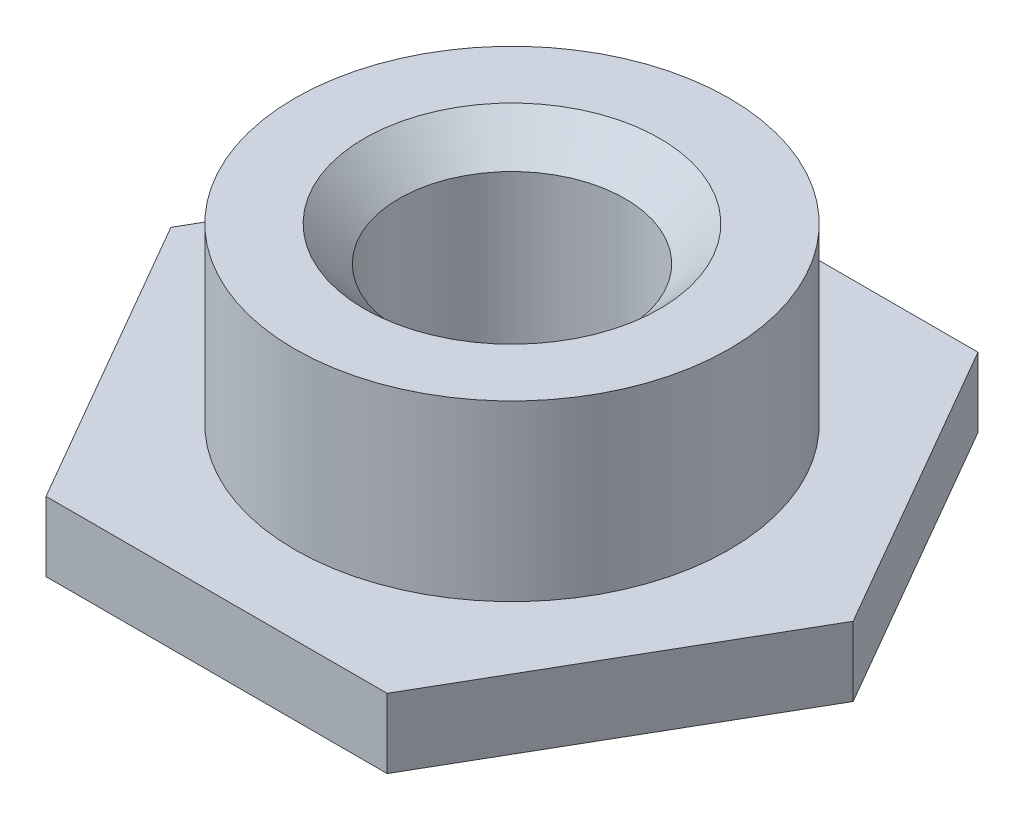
ISO-10303-21;
HEADER;
FILE_DESCRIPTION(('STEP AP214'),'2;1');
FILE_NAME('part.step','',(''),(''),'','','');
FILE_SCHEMA(('AUTOMOTIVE_DESIGN { 1 0 10303 214 1 1 1 1 }'));
ENDSEC;
DATA;
#1=APPLICATION_CONTEXT('core data for automotive mechanical design processes');
#2=APPLICATION_PROTOCOL_DEFINITION('international standard','automotive_design',2000,#1);
#3=PRODUCT_CONTEXT('',#1,'mechanical');
#4=PRODUCT('Part','Part','',(#3));
#5=PRODUCT_RELATED_PRODUCT_CATEGORY('part','',(#4));
#6=PRODUCT_DEFINITION_FORMATION('','',#4);
#7=PRODUCT_DEFINITION_CONTEXT('part definition',#1,'design');
#8=PRODUCT_DEFINITION('design','',#6,#7);
#9=PRODUCT_DEFINITION_SHAPE('','',#8);
#10=(LENGTH_UNIT() NAMED_UNIT(*) SI_UNIT(.MILLI.,.METRE.));
#11=(NAMED_UNIT(*) PLANE_ANGLE_UNIT() SI_UNIT($,.RADIAN.));
#12=(NAMED_UNIT(*) SI_UNIT($,.STERADIAN.) SOLID_ANGLE_UNIT());
#13=UNCERTAINTY_MEASURE_WITH_UNIT(LENGTH_MEASURE(1.E-05),#10,'distance_accuracy_value','');
#14=(GEOMETRIC_REPRESENTATION_CONTEXT(3) GLOBAL_UNCERTAINTY_ASSIGNED_CONTEXT((#13)) GLOBAL_UNIT_ASSIGNED_CONTEXT((#10,
#11,#12)) REPRESENTATION_CONTEXT('',''));
#15=CARTESIAN_POINT('',(0.,0.,0.));
#16=DIRECTION('',(0.,0.,1.));
#17=DIRECTION('',(1.,0.,0.));
#18=AXIS2_PLACEMENT_3D('',#15,#16,#17);
#19=CARTESIAN_POINT('',(4.90747728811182,2.,8.5));
#20=DIRECTION('',(-0.866025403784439,0.,-0.5));
#21=DIRECTION('',(-0.5,0.,0.866025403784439));
#22=AXIS2_PLACEMENT_3D('',#19,#20,#21);
#23=PLANE('',#22);
#24=DIRECTION('',(0.5,0.,-0.866025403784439));
#25=VECTOR('',#24,1.);
#26=CARTESIAN_POINT('',(4.90747728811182,0.,8.5));
#27=LINE('',#26,#25);
#28=CARTESIAN_POINT('',(4.90747728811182,0.,8.5));
#29=VERTEX_POINT('',#28);
#30=CARTESIAN_POINT('',(9.81495457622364,0.,0.));
#31=VERTEX_POINT('',#30);
#32=EDGE_CURVE('E130',#29,#31,#27,.T.);
#33=ORIENTED_EDGE('',*,*,#32,.T.);
#34=DIRECTION('',(0.,-1.,0.));
#35=VECTOR('',#34,1.);
#36=CARTESIAN_POINT('',(9.81495457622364,2.,0.));
#37=LINE('',#36,#35);
#38=CARTESIAN_POINT('',(9.81495457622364,2.,0.));
#39=VERTEX_POINT('',#38);
#40=EDGE_CURVE('E158',#39,#31,#37,.T.);
#41=ORIENTED_EDGE('',*,*,#40,.F.);
#42=DIRECTION('',(0.5,0.,-0.866025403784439));
#43=VECTOR('',#42,1.);
#44=CARTESIAN_POINT('',(4.90747728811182,2.,8.5));
#45=LINE('',#44,#43);
#46=CARTESIAN_POINT('',(4.90747728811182,2.,8.5));
#47=VERTEX_POINT('',#46);
#48=EDGE_CURVE('E147',#47,#39,#45,.T.);
#49=ORIENTED_EDGE('',*,*,#48,.F.);
#50=DIRECTION('',(0.,-1.,0.));
#51=VECTOR('',#50,1.);
#52=CARTESIAN_POINT('',(4.90747728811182,2.,8.5));
#53=LINE('',#52,#51);
#54=EDGE_CURVE('E126',#47,#29,#53,.T.);
#55=ORIENTED_EDGE('',*,*,#54,.T.);
#56=EDGE_LOOP('',(#33,#41,#49,#55));
#57=FACE_BOUND('',#56,.T.);
#58=ADVANCED_FACE('F39',(#57),#23,.F.);
#59=CARTESIAN_POINT('',(9.81495457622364,2.,0.));
#60=DIRECTION('',(-0.866025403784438,0.,0.5));
#61=DIRECTION('',(0.5,0.,0.866025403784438));
#62=AXIS2_PLACEMENT_3D('',#59,#60,#61);
#63=PLANE('',#62);
#64=DIRECTION('',(-0.5,0.,-0.866025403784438));
#65=VECTOR('',#64,1.);
#66=CARTESIAN_POINT('',(9.81495457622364,0.,0.));
#67=LINE('',#66,#65);
#68=CARTESIAN_POINT('',(4.90747728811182,0.,-8.5));
#69=VERTEX_POINT('',#68);
#70=EDGE_CURVE('E134',#31,#69,#67,.T.);
#71=ORIENTED_EDGE('',*,*,#70,.T.);
#72=DIRECTION('',(0.,-1.,0.));
#73=VECTOR('',#72,1.);
#74=CARTESIAN_POINT('',(4.90747728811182,2.,-8.5));
#75=LINE('',#74,#73);
#76=CARTESIAN_POINT('',(4.90747728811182,2.,-8.5));
#77=VERTEX_POINT('',#76);
#78=EDGE_CURVE('E154',#77,#69,#75,.T.);
#79=ORIENTED_EDGE('',*,*,#78,.F.);
#80=DIRECTION('',(-0.5,0.,-0.866025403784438));
#81=VECTOR('',#80,1.);
#82=CARTESIAN_POINT('',(9.81495457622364,2.,0.));
#83=LINE('',#82,#81);
#84=EDGE_CURVE('E95',#39,#77,#83,.T.);
#85=ORIENTED_EDGE('',*,*,#84,.F.);
#86=ORIENTED_EDGE('',*,*,#40,.T.);
#87=EDGE_LOOP('',(#71,#79,#85,#86));
#88=FACE_BOUND('',#87,.T.);
#89=ADVANCED_FACE('F186',(#88),#63,.F.);
#90=CARTESIAN_POINT('',(4.90747728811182,2.,-8.5));
#91=DIRECTION('',(0.,0.,1.));
#92=DIRECTION('',(1.,0.,0.));
#93=AXIS2_PLACEMENT_3D('',#90,#91,#92);
#94=PLANE('',#93);
#95=DIRECTION('',(-1.,0.,0.));
#96=VECTOR('',#95,1.);
#97=CARTESIAN_POINT('',(4.90747728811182,0.,-8.5));
#98=LINE('',#97,#96);
#99=CARTESIAN_POINT('',(-4.90747728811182,0.,-8.5));
#100=VERTEX_POINT('',#99);
#101=EDGE_CURVE('E138',#69,#100,#98,.T.);
#102=ORIENTED_EDGE('',*,*,#101,.T.);
#103=DIRECTION('',(0.,-1.,0.));
#104=VECTOR('',#103,1.);
#105=CARTESIAN_POINT('',(-4.90747728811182,2.,-8.5));
#106=LINE('',#105,#104);
#107=CARTESIAN_POINT('',(-4.90747728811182,2.,-8.5));
#108=VERTEX_POINT('',#107);
#109=EDGE_CURVE('E119',#108,#100,#106,.T.);
#110=ORIENTED_EDGE('',*,*,#109,.F.);
#111=DIRECTION('',(-1.,0.,0.));
#112=VECTOR('',#111,1.);
#113=CARTESIAN_POINT('',(4.90747728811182,2.,-8.5));
#114=LINE('',#113,#112);
#115=EDGE_CURVE('E108',#77,#108,#114,.T.);
#116=ORIENTED_EDGE('',*,*,#115,.F.);
#117=ORIENTED_EDGE('',*,*,#78,.T.);
#118=EDGE_LOOP('',(#102,#110,#116,#117));
#119=FACE_BOUND('',#118,.T.);
#120=ADVANCED_FACE('F192',(#119),#94,.F.);
#121=CARTESIAN_POINT('',(-4.90747728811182,2.,-8.5));
#122=DIRECTION('',(0.866025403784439,0.,0.5));
#123=DIRECTION('',(0.5,0.,-0.866025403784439));
#124=AXIS2_PLACEMENT_3D('',#121,#122,#123);
#125=PLANE('',#124);
#126=DIRECTION('',(-0.5,0.,0.866025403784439));
#127=VECTOR('',#126,1.);
#128=CARTESIAN_POINT('',(-4.90747728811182,0.,-8.5));
#129=LINE('',#128,#127);
#130=CARTESIAN_POINT('',(-9.81495457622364,0.,0.));
#131=VERTEX_POINT('',#130);
#132=EDGE_CURVE('E117',#100,#131,#129,.T.);
#133=ORIENTED_EDGE('',*,*,#132,.T.);
#134=DIRECTION('',(0.,-1.,0.));
#135=VECTOR('',#134,1.);
#136=CARTESIAN_POINT('',(-9.81495457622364,2.,0.));
#137=LINE('',#136,#135);
#138=CARTESIAN_POINT('',(-9.81495457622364,2.,0.));
#139=VERTEX_POINT('',#138);
#140=EDGE_CURVE('E114',#139,#131,#137,.T.);
#141=ORIENTED_EDGE('',*,*,#140,.F.);
#142=DIRECTION('',(-0.5,0.,0.866025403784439));
#143=VECTOR('',#142,1.);
#144=CARTESIAN_POINT('',(-4.90747728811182,2.,-8.5));
#145=LINE('',#144,#143);
#146=EDGE_CURVE('E102',#108,#139,#145,.T.);
#147=ORIENTED_EDGE('',*,*,#146,.F.);
#148=ORIENTED_EDGE('',*,*,#109,.T.);
#149=EDGE_LOOP('',(#133,#141,#147,#148));
#150=FACE_BOUND('',#149,.T.);
#151=ADVANCED_FACE('F115',(#150),#125,.F.);
#152=CARTESIAN_POINT('',(-9.81495457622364,2.,0.));
#153=DIRECTION('',(0.866025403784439,0.,-0.5));
#154=DIRECTION('',(-0.5,0.,-0.866025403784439));
#155=AXIS2_PLACEMENT_3D('',#152,#153,#154);
#156=PLANE('',#155);
#157=DIRECTION('',(0.5,0.,0.866025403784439));
#158=VECTOR('',#157,1.);
#159=CARTESIAN_POINT('',(-9.81495457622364,0.,0.));
#160=LINE('',#159,#158);
#161=CARTESIAN_POINT('',(-4.90747728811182,0.,8.5));
#162=VERTEX_POINT('',#161);
#163=EDGE_CURVE('E80',#131,#162,#160,.T.);
#164=ORIENTED_EDGE('',*,*,#163,.T.);
#165=DIRECTION('',(0.,-1.,0.));
#166=VECTOR('',#165,1.);
#167=CARTESIAN_POINT('',(-4.90747728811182,2.,8.5));
#168=LINE('',#167,#166);
#169=CARTESIAN_POINT('',(-4.90747728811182,2.,8.5));
#170=VERTEX_POINT('',#169);
#171=EDGE_CURVE('E120',#170,#162,#168,.T.);
#172=ORIENTED_EDGE('',*,*,#171,.F.);
#173=DIRECTION('',(0.5,0.,0.866025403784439));
#174=VECTOR('',#173,1.);
#175=CARTESIAN_POINT('',(-9.81495457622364,2.,0.));
#176=LINE('',#175,#174);
#177=EDGE_CURVE('E106',#139,#170,#176,.T.);
#178=ORIENTED_EDGE('',*,*,#177,.F.);
#179=ORIENTED_EDGE('',*,*,#140,.T.);
#180=EDGE_LOOP('',(#164,#172,#178,#179));
#181=FACE_BOUND('',#180,.T.);
#182=ADVANCED_FACE('F122',(#181),#156,.F.);
#183=CARTESIAN_POINT('',(-4.90747728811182,2.,8.5));
#184=DIRECTION('',(0.,0.,-1.));
#185=DIRECTION('',(-1.,0.,0.));
#186=AXIS2_PLACEMENT_3D('',#183,#184,#185);
#187=PLANE('',#186);
#188=DIRECTION('',(1.,0.,0.));
#189=VECTOR('',#188,1.);
#190=CARTESIAN_POINT('',(-4.90747728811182,0.,8.5));
#191=LINE('',#190,#189);
#192=EDGE_CURVE('E86',#162,#29,#191,.T.);
#193=ORIENTED_EDGE('',*,*,#192,.T.);
#194=ORIENTED_EDGE('',*,*,#54,.F.);
#195=DIRECTION('',(1.,0.,0.));
#196=VECTOR('',#195,1.);
#197=CARTESIAN_POINT('',(-4.90747728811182,2.,8.5));
#198=LINE('',#197,#196);
#199=EDGE_CURVE('E57',#170,#47,#198,.T.);
#200=ORIENTED_EDGE('',*,*,#199,.F.);
#201=ORIENTED_EDGE('',*,*,#171,.T.);
#202=EDGE_LOOP('',(#193,#194,#200,#201));
#203=FACE_BOUND('',#202,.T.);
#204=ADVANCED_FACE('F202',(#203),#187,.F.);
#205=CARTESIAN_POINT('',(0.,2.,0.));
#206=DIRECTION('',(0.,1.,0.));
#207=DIRECTION('',(0.,0.,1.));
#208=AXIS2_PLACEMENT_3D('',#205,#206,#207);
#209=PLANE('',#208);
#210=CARTESIAN_POINT('',(0.,2.,0.));
#211=DIRECTION('',(0.,1.,0.));
#212=DIRECTION('',(0.,0.,1.));
#213=AXIS2_PLACEMENT_3D('',#210,#211,#212);
#214=CIRCLE('',#213,6.25);
#215=CARTESIAN_POINT('',(0.,2.,6.25));
#216=VERTEX_POINT('',#215);
#217=EDGE_CURVE('E161',#216,#216,#214,.T.);
#218=ORIENTED_EDGE('',*,*,#217,.F.);
#219=EDGE_LOOP('',(#218));
#220=FACE_BOUND('',#219,.T.);
#221=ORIENTED_EDGE('',*,*,#48,.T.);
#222=ORIENTED_EDGE('',*,*,#84,.T.);
#223=ORIENTED_EDGE('',*,*,#115,.T.);
#224=ORIENTED_EDGE('',*,*,#146,.T.);
#225=ORIENTED_EDGE('',*,*,#177,.T.);
#226=ORIENTED_EDGE('',*,*,#199,.T.);
#227=EDGE_LOOP('',(#221,#222,#223,#224,#225,#226));
#228=FACE_BOUND('',#227,.T.);
#229=ADVANCED_FACE('F104',(#220,#228),#209,.T.);
#230=CARTESIAN_POINT('',(0.,0.,0.));
#231=DIRECTION('',(0.,1.,0.));
#232=DIRECTION('',(0.,0.,1.));
#233=AXIS2_PLACEMENT_3D('',#230,#231,#232);
#234=PLANE('',#233);
#235=CARTESIAN_POINT('',(0.,0.,0.));
#236=DIRECTION('',(0.,1.,0.));
#237=DIRECTION('',(0.,0.,1.));
#238=AXIS2_PLACEMENT_3D('',#235,#236,#237);
#239=CIRCLE('',#238,3.75);
#240=CARTESIAN_POINT('',(0.,0.,3.75));
#241=VERTEX_POINT('',#240);
#242=EDGE_CURVE('E49',#241,#241,#239,.T.);
#243=ORIENTED_EDGE('',*,*,#242,.T.);
#244=EDGE_LOOP('',(#243));
#245=FACE_BOUND('',#244,.T.);
#246=ORIENTED_EDGE('',*,*,#32,.F.);
#247=ORIENTED_EDGE('',*,*,#192,.F.);
#248=ORIENTED_EDGE('',*,*,#163,.F.);
#249=ORIENTED_EDGE('',*,*,#132,.F.);
#250=ORIENTED_EDGE('',*,*,#101,.F.);
#251=ORIENTED_EDGE('',*,*,#70,.F.);
#252=EDGE_LOOP('',(#246,#247,#248,#249,#250,#251));
#253=FACE_BOUND('',#252,.T.);
#254=ADVANCED_FACE('F173',(#245,#253),#234,.F.);
#255=CARTESIAN_POINT('',(0.,7.,0.));
#256=DIRECTION('',(0.,-1.,0.));
#257=DIRECTION('',(0.,0.,-1.));
#258=AXIS2_PLACEMENT_3D('',#255,#256,#257);
#259=CYLINDRICAL_SURFACE('',#258,6.25);
#260=CARTESIAN_POINT('',(0.,7.,0.));
#261=DIRECTION('',(0.,1.,0.));
#262=DIRECTION('',(0.,0.,1.));
#263=AXIS2_PLACEMENT_3D('',#260,#261,#262);
#264=CIRCLE('',#263,6.25);
#265=CARTESIAN_POINT('',(0.,7.,6.25));
#266=VERTEX_POINT('',#265);
#267=EDGE_CURVE('E135',#266,#266,#264,.T.);
#268=ORIENTED_EDGE('',*,*,#267,.F.);
#269=EDGE_LOOP('',(#268));
#270=FACE_BOUND('',#269,.T.);
#271=ORIENTED_EDGE('',*,*,#217,.T.);
#272=EDGE_LOOP('',(#271));
#273=FACE_BOUND('',#272,.T.);
#274=ADVANCED_FACE('F207',(#270,#273),#259,.T.);
#275=CARTESIAN_POINT('',(0.,7.,0.));
#276=DIRECTION('',(0.,1.,0.));
#277=DIRECTION('',(0.,0.,1.));
#278=AXIS2_PLACEMENT_3D('',#275,#276,#277);
#279=PLANE('',#278);
#280=CARTESIAN_POINT('',(0.,7.,0.));
#281=DIRECTION('',(0.,1.,0.));
#282=DIRECTION('',(0.,0.,1.));
#283=AXIS2_PLACEMENT_3D('',#280,#281,#282);
#284=CIRCLE('',#283,4.25);
#285=CARTESIAN_POINT('',(0.,7.,4.25));
#286=VERTEX_POINT('',#285);
#287=EDGE_CURVE('E166',#286,#286,#284,.F.);
#288=ORIENTED_EDGE('',*,*,#287,.T.);
#289=EDGE_LOOP('',(#288));
#290=FACE_BOUND('',#289,.T.);
#291=ORIENTED_EDGE('',*,*,#267,.T.);
#292=EDGE_LOOP('',(#291));
#293=FACE_BOUND('',#292,.T.);
#294=ADVANCED_FACE('F213',(#290,#293),#279,.T.);
#295=CARTESIAN_POINT('',(0.,0.,0.));
#296=DIRECTION('',(0.,1.,0.));
#297=DIRECTION('',(0.,0.,1.));
#298=AXIS2_PLACEMENT_3D('',#295,#296,#297);
#299=CYLINDRICAL_SURFACE('',#298,3.25);
#300=CARTESIAN_POINT('',(0.,0.500000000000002,0.));
#301=DIRECTION('',(0.,1.,0.));
#302=DIRECTION('',(0.,0.,1.));
#303=AXIS2_PLACEMENT_3D('',#300,#301,#302);
#304=CIRCLE('',#303,3.25);
#305=CARTESIAN_POINT('',(0.,0.500000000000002,3.25));
#306=VERTEX_POINT('',#305);
#307=EDGE_CURVE('E11',#306,#306,#304,.F.);
#308=ORIENTED_EDGE('',*,*,#307,.T.);
#309=EDGE_LOOP('',(#308));
#310=FACE_BOUND('',#309,.T.);
#311=CARTESIAN_POINT('',(0.,6.00000000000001,0.));
#312=DIRECTION('',(0.,1.,0.));
#313=DIRECTION('',(0.,0.,1.));
#314=AXIS2_PLACEMENT_3D('',#311,#312,#313);
#315=CIRCLE('',#314,3.25);
#316=CARTESIAN_POINT('',(0.,6.00000000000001,3.25));
#317=VERTEX_POINT('',#316);
#318=EDGE_CURVE('E162',#317,#317,#315,.T.);
#319=ORIENTED_EDGE('',*,*,#318,.T.);
#320=EDGE_LOOP('',(#319));
#321=FACE_BOUND('',#320,.T.);
#322=ADVANCED_FACE('F182',(#310,#321),#299,.F.);
#323=CARTESIAN_POINT('',(0.,6.00000000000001,0.));
#324=DIRECTION('',(0.,1.,0.));
#325=DIRECTION('',(0.,0.,1.));
#326=AXIS2_PLACEMENT_3D('',#323,#324,#325);
#327=CONICAL_SURFACE('',#326,3.25,0.78539816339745);
#328=ORIENTED_EDGE('',*,*,#287,.F.);
#329=EDGE_LOOP('',(#328));
#330=FACE_BOUND('',#329,.T.);
#331=ORIENTED_EDGE('',*,*,#318,.F.);
#332=EDGE_LOOP('',(#331));
#333=FACE_BOUND('',#332,.T.);
#334=ADVANCED_FACE('F177',(#330,#333),#327,.F.);
#335=CARTESIAN_POINT('',(0.,0.,0.));
#336=DIRECTION('',(0.,-1.,0.));
#337=DIRECTION('',(0.,0.,-1.));
#338=AXIS2_PLACEMENT_3D('',#335,#336,#337);
#339=CONICAL_SURFACE('',#338,3.75,0.785398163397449);
#340=ORIENTED_EDGE('',*,*,#307,.F.);
#341=EDGE_LOOP('',(#340));
#342=FACE_BOUND('',#341,.T.);
#343=ORIENTED_EDGE('',*,*,#242,.F.);
#344=EDGE_LOOP('',(#343));
#345=FACE_BOUND('',#344,.T.);
#346=ADVANCED_FACE('F41',(#342,#345),#339,.F.);
#347=CLOSED_SHELL('',(#58,#89,#120,#151,#182,#204,#229,#254,#274,#294,#322,#334,#346));
#348=MANIFOLD_SOLID_BREP('B2',#347);
#349=ADVANCED_BREP_SHAPE_REPRESENTATION('',(#18,#348),#14);
#350=SHAPE_DEFINITION_REPRESENTATION(#9,#349);
ENDSEC;
END-ISO-10303-21;
